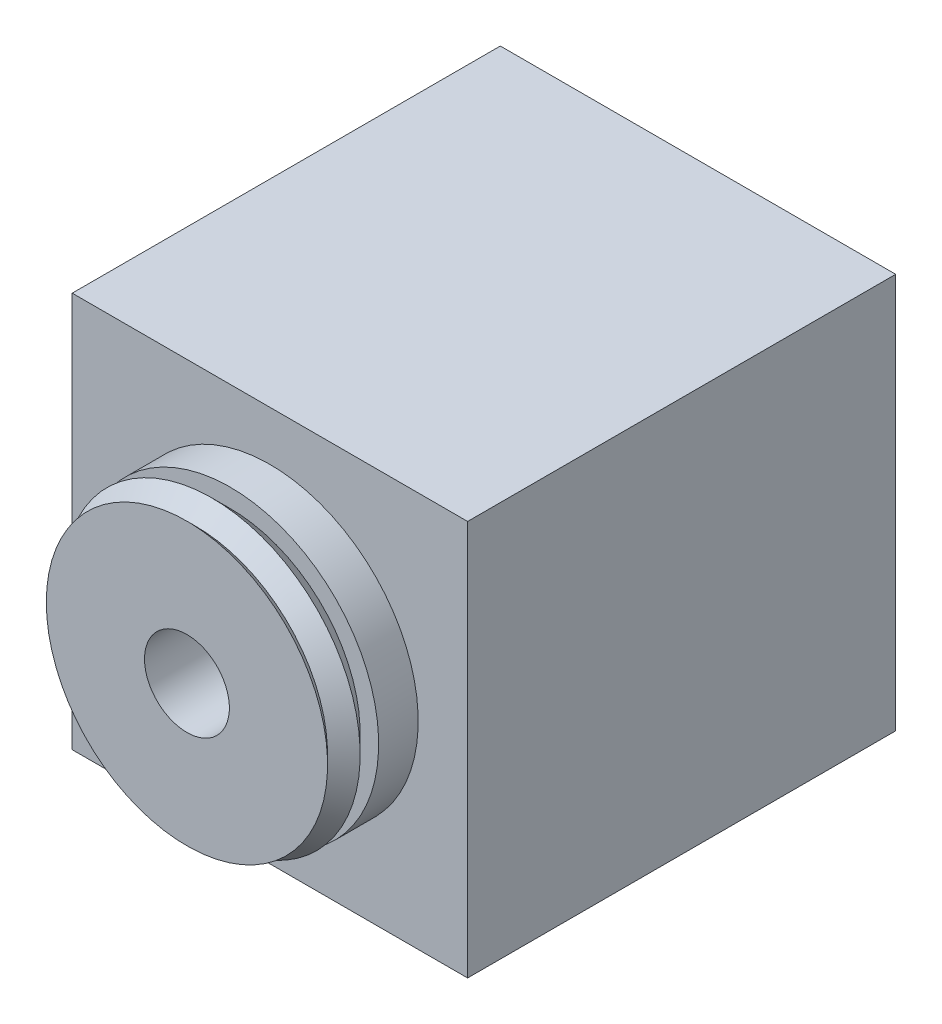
ISO-10303-21;
HEADER;
FILE_DESCRIPTION(('STEP AP214'),'2;1');
FILE_NAME('part.step','',(''),(''),'','','');
FILE_SCHEMA(('AUTOMOTIVE_DESIGN { 1 0 10303 214 1 1 1 1 }'));
ENDSEC;
DATA;
#1=APPLICATION_CONTEXT('core data for automotive mechanical design processes');
#2=APPLICATION_PROTOCOL_DEFINITION('international standard','automotive_design',2000,#1);
#3=PRODUCT_CONTEXT('',#1,'mechanical');
#4=PRODUCT('Part','Part','',(#3));
#5=PRODUCT_RELATED_PRODUCT_CATEGORY('part','',(#4));
#6=PRODUCT_DEFINITION_FORMATION('','',#4);
#7=PRODUCT_DEFINITION_CONTEXT('part definition',#1,'design');
#8=PRODUCT_DEFINITION('design','',#6,#7);
#9=PRODUCT_DEFINITION_SHAPE('','',#8);
#10=(LENGTH_UNIT() NAMED_UNIT(*) SI_UNIT(.MILLI.,.METRE.));
#11=(NAMED_UNIT(*) PLANE_ANGLE_UNIT() SI_UNIT($,.RADIAN.));
#12=(NAMED_UNIT(*) SI_UNIT($,.STERADIAN.) SOLID_ANGLE_UNIT());
#13=UNCERTAINTY_MEASURE_WITH_UNIT(LENGTH_MEASURE(1.E-05),#10,'distance_accuracy_value','');
#14=(GEOMETRIC_REPRESENTATION_CONTEXT(3) GLOBAL_UNCERTAINTY_ASSIGNED_CONTEXT((#13)) GLOBAL_UNIT_ASSIGNED_CONTEXT((#10,
#11,#12)) REPRESENTATION_CONTEXT('',''));
#15=CARTESIAN_POINT('',(0.,0.,0.));
#16=DIRECTION('',(0.,0.,1.));
#17=DIRECTION('',(1.,0.,0.));
#18=AXIS2_PLACEMENT_3D('',#15,#16,#17);
#19=CARTESIAN_POINT('',(0.,0.,0.));
#20=DIRECTION('',(0.,0.,1.));
#21=DIRECTION('',(1.,0.,0.));
#22=AXIS2_PLACEMENT_3D('',#19,#20,#21);
#23=PLANE('',#22);
#24=CARTESIAN_POINT('',(0.,0.,0.));
#25=DIRECTION('',(0.,0.,-1.));
#26=DIRECTION('',(-1.,0.,0.));
#27=AXIS2_PLACEMENT_3D('',#24,#25,#26);
#28=CIRCLE('',#27,6.77545);
#29=CARTESIAN_POINT('',(-6.77545,0.,0.));
#30=VERTEX_POINT('',#29);
#31=EDGE_CURVE('E11',#30,#30,#28,.T.);
#32=ORIENTED_EDGE('',*,*,#31,.F.);
#33=EDGE_LOOP('',(#32));
#34=FACE_BOUND('',#33,.T.);
#35=CARTESIAN_POINT('',(0.,0.,0.));
#36=DIRECTION('',(0.,0.,-1.));
#37=DIRECTION('',(-1.,0.,0.));
#38=AXIS2_PLACEMENT_3D('',#35,#36,#37);
#39=CIRCLE('',#38,2.0447);
#40=CARTESIAN_POINT('',(-2.0447,0.,0.));
#41=VERTEX_POINT('',#40);
#42=EDGE_CURVE('E152',#41,#41,#39,.T.);
#43=ORIENTED_EDGE('',*,*,#42,.T.);
#44=EDGE_LOOP('',(#43));
#45=FACE_BOUND('',#44,.T.);
#46=ADVANCED_FACE('F35',(#34,#45),#23,.T.);
#47=CARTESIAN_POINT('',(0.,0.,-26.197814));
#48=DIRECTION('',(0.,0.,-1.));
#49=DIRECTION('',(-1.,0.,0.));
#50=AXIS2_PLACEMENT_3D('',#47,#48,#49);
#51=PLANE('',#50);
#52=CARTESIAN_POINT('',(0.,0.,-26.197814));
#53=DIRECTION('',(0.,0.,-1.));
#54=DIRECTION('',(-1.,0.,0.));
#55=AXIS2_PLACEMENT_3D('',#52,#53,#54);
#56=CIRCLE('',#55,5.55625);
#57=CARTESIAN_POINT('',(-5.55625,0.,-26.197814));
#58=VERTEX_POINT('',#57);
#59=EDGE_CURVE('E160',#58,#58,#56,.T.);
#60=ORIENTED_EDGE('',*,*,#59,.T.);
#61=EDGE_LOOP('',(#60));
#62=FACE_BOUND('',#61,.T.);
#63=CARTESIAN_POINT('',(0.,0.,-26.197814));
#64=DIRECTION('',(0.,0.,-1.));
#65=DIRECTION('',(-1.,0.,0.));
#66=AXIS2_PLACEMENT_3D('',#63,#64,#65);
#67=CIRCLE('',#66,2.0447);
#68=CARTESIAN_POINT('',(-2.0447,0.,-26.197814));
#69=VERTEX_POINT('',#68);
#70=EDGE_CURVE('E154',#69,#69,#67,.T.);
#71=ORIENTED_EDGE('',*,*,#70,.F.);
#72=EDGE_LOOP('',(#71));
#73=FACE_BOUND('',#72,.T.);
#74=ADVANCED_FACE('F139',(#62,#73),#51,.T.);
#75=CARTESIAN_POINT('',(9.525,9.525,-24.623014));
#76=DIRECTION('',(0.,0.,-1.));
#77=DIRECTION('',(-1.,0.,0.));
#78=AXIS2_PLACEMENT_3D('',#75,#76,#77);
#79=PLANE('',#78);
#80=DIRECTION('',(0.,-1.,0.));
#81=VECTOR('',#80,1.);
#82=CARTESIAN_POINT('',(9.525,9.525,-24.623014));
#83=LINE('',#82,#81);
#84=CARTESIAN_POINT('',(9.525,9.525,-24.623014));
#85=VERTEX_POINT('',#84);
#86=CARTESIAN_POINT('',(9.525,-9.525,-24.623014));
#87=VERTEX_POINT('',#86);
#88=EDGE_CURVE('E88',#85,#87,#83,.T.);
#89=ORIENTED_EDGE('',*,*,#88,.T.);
#90=DIRECTION('',(-1.,0.,0.));
#91=VECTOR('',#90,1.);
#92=CARTESIAN_POINT('',(9.525,-9.525,-24.623014));
#93=LINE('',#92,#91);
#94=CARTESIAN_POINT('',(-9.525,-9.525,-24.623014));
#95=VERTEX_POINT('',#94);
#96=EDGE_CURVE('E82',#87,#95,#93,.T.);
#97=ORIENTED_EDGE('',*,*,#96,.T.);
#98=DIRECTION('',(0.,1.,0.));
#99=VECTOR('',#98,1.);
#100=CARTESIAN_POINT('',(-9.525,9.525,-24.623014));
#101=LINE('',#100,#99);
#102=CARTESIAN_POINT('',(-9.525,9.525,-24.623014));
#103=VERTEX_POINT('',#102);
#104=EDGE_CURVE('E86',#95,#103,#101,.T.);
#105=ORIENTED_EDGE('',*,*,#104,.T.);
#106=DIRECTION('',(1.,0.,0.));
#107=VECTOR('',#106,1.);
#108=CARTESIAN_POINT('',(9.525,9.525,-24.623014));
#109=LINE('',#108,#107);
#110=EDGE_CURVE('E51',#103,#85,#109,.T.);
#111=ORIENTED_EDGE('',*,*,#110,.T.);
#112=EDGE_LOOP('',(#89,#97,#105,#111));
#113=FACE_BOUND('',#112,.T.);
#114=CARTESIAN_POINT('',(-6.91950784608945,6.55087633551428,-24.623014));
#115=DIRECTION('',(0.,0.,-1.));
#116=DIRECTION('',(-1.,0.,0.));
#117=AXIS2_PLACEMENT_3D('',#114,#115,#116);
#118=CIRCLE('',#117,1.7272);
#119=CARTESIAN_POINT('',(-8.64670784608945,6.55087633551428,-24.623014));
#120=VERTEX_POINT('',#119);
#121=EDGE_CURVE('E181',#120,#120,#118,.T.);
#122=ORIENTED_EDGE('',*,*,#121,.F.);
#123=EDGE_LOOP('',(#122));
#124=FACE_BOUND('',#123,.T.);
#125=CARTESIAN_POINT('',(6.55087633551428,-6.91950784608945,-24.623014));
#126=DIRECTION('',(0.,0.,-1.));
#127=DIRECTION('',(1.,0.,0.));
#128=AXIS2_PLACEMENT_3D('',#125,#126,#127);
#129=CIRCLE('',#128,1.7272);
#130=CARTESIAN_POINT('',(8.27807633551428,-6.91950784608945,-24.623014));
#131=VERTEX_POINT('',#130);
#132=EDGE_CURVE('E175',#131,#131,#129,.T.);
#133=ORIENTED_EDGE('',*,*,#132,.F.);
#134=EDGE_LOOP('',(#133));
#135=FACE_BOUND('',#134,.T.);
#136=CARTESIAN_POINT('',(0.,0.,-24.623014));
#137=DIRECTION('',(0.,0.,-1.));
#138=DIRECTION('',(-1.,0.,0.));
#139=AXIS2_PLACEMENT_3D('',#136,#137,#138);
#140=CIRCLE('',#139,5.55625);
#141=CARTESIAN_POINT('',(-5.55625,0.,-24.623014));
#142=VERTEX_POINT('',#141);
#143=EDGE_CURVE('E157',#142,#142,#140,.T.);
#144=ORIENTED_EDGE('',*,*,#143,.F.);
#145=EDGE_LOOP('',(#144));
#146=FACE_BOUND('',#145,.T.);
#147=ADVANCED_FACE('F83',(#113,#124,#135,#146),#79,.T.);
#148=CARTESIAN_POINT('',(0.,0.,-0.416559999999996));
#149=DIRECTION('',(0.,0.,1.));
#150=DIRECTION('',(1.,0.,0.));
#151=AXIS2_PLACEMENT_3D('',#148,#149,#150);
#152=CONICAL_SURFACE('',#151,6.35889,0.785398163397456);
#153=ORIENTED_EDGE('',*,*,#31,.T.);
#154=EDGE_LOOP('',(#153));
#155=FACE_BOUND('',#154,.T.);
#156=CARTESIAN_POINT('',(0.,0.,-0.416559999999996));
#157=DIRECTION('',(0.,0.,-1.));
#158=DIRECTION('',(-1.,0.,0.));
#159=AXIS2_PLACEMENT_3D('',#156,#157,#158);
#160=CIRCLE('',#159,6.35889);
#161=CARTESIAN_POINT('',(-6.35889,0.,-0.416559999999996));
#162=VERTEX_POINT('',#161);
#163=EDGE_CURVE('E43',#162,#162,#160,.T.);
#164=ORIENTED_EDGE('',*,*,#163,.F.);
#165=EDGE_LOOP('',(#164));
#166=FACE_BOUND('',#165,.T.);
#167=ADVANCED_FACE('F130',(#155,#166),#152,.T.);
#168=CARTESIAN_POINT('',(0.,0.,-1.20141999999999));
#169=DIRECTION('',(0.,0.,-1.));
#170=DIRECTION('',(-1.,0.,0.));
#171=AXIS2_PLACEMENT_3D('',#168,#169,#170);
#172=CONICAL_SURFACE('',#171,7.14374999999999,0.785398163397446);
#173=ORIENTED_EDGE('',*,*,#163,.T.);
#174=EDGE_LOOP('',(#173));
#175=FACE_BOUND('',#174,.T.);
#176=CARTESIAN_POINT('',(0.,0.,-1.20141999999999));
#177=DIRECTION('',(0.,0.,-1.));
#178=DIRECTION('',(-1.,0.,0.));
#179=AXIS2_PLACEMENT_3D('',#176,#177,#178);
#180=CIRCLE('',#179,7.14374999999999);
#181=CARTESIAN_POINT('',(-7.14374999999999,0.,-1.20141999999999));
#182=VERTEX_POINT('',#181);
#183=EDGE_CURVE('E122',#182,#182,#180,.T.);
#184=ORIENTED_EDGE('',*,*,#183,.F.);
#185=EDGE_LOOP('',(#184));
#186=FACE_BOUND('',#185,.T.);
#187=ADVANCED_FACE('F127',(#175,#186),#172,.T.);
#188=CARTESIAN_POINT('',(0.,0.,-2.093214));
#189=DIRECTION('',(0.,0.,1.));
#190=DIRECTION('',(1.,0.,0.));
#191=AXIS2_PLACEMENT_3D('',#188,#189,#190);
#192=CONICAL_SURFACE('',#191,6.25195599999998,0.785398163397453);
#193=ORIENTED_EDGE('',*,*,#183,.T.);
#194=EDGE_LOOP('',(#193));
#195=FACE_BOUND('',#194,.T.);
#196=CARTESIAN_POINT('',(0.,0.,-2.093214));
#197=DIRECTION('',(0.,0.,-1.));
#198=DIRECTION('',(-1.,0.,0.));
#199=AXIS2_PLACEMENT_3D('',#196,#197,#198);
#200=CIRCLE('',#199,6.25195599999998);
#201=CARTESIAN_POINT('',(-6.25195599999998,0.,-2.093214));
#202=VERTEX_POINT('',#201);
#203=EDGE_CURVE('E119',#202,#202,#200,.T.);
#204=ORIENTED_EDGE('',*,*,#203,.F.);
#205=EDGE_LOOP('',(#204));
#206=FACE_BOUND('',#205,.T.);
#207=ADVANCED_FACE('F137',(#195,#206),#192,.T.);
#208=CARTESIAN_POINT('',(0.,6.25195599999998,-2.093214));
#209=DIRECTION('',(0.,0.,1.));
#210=DIRECTION('',(1.,0.,0.));
#211=AXIS2_PLACEMENT_3D('',#208,#209,#210);
#212=PLANE('',#211);
#213=ORIENTED_EDGE('',*,*,#203,.T.);
#214=EDGE_LOOP('',(#213));
#215=FACE_BOUND('',#214,.T.);
#216=CARTESIAN_POINT('',(0.,0.,-2.093214));
#217=DIRECTION('',(0.,0.,-1.));
#218=DIRECTION('',(-1.,0.,0.));
#219=AXIS2_PLACEMENT_3D('',#216,#217,#218);
#220=CIRCLE('',#219,7.14374999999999);
#221=CARTESIAN_POINT('',(-7.14374999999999,0.,-2.093214));
#222=VERTEX_POINT('',#221);
#223=EDGE_CURVE('E116',#222,#222,#220,.T.);
#224=ORIENTED_EDGE('',*,*,#223,.F.);
#225=EDGE_LOOP('',(#224));
#226=FACE_BOUND('',#225,.T.);
#227=ADVANCED_FACE('F257',(#215,#226),#212,.T.);
#228=CARTESIAN_POINT('',(0.,0.,-71.2941240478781));
#229=DIRECTION('',(0.,0.,-1.));
#230=DIRECTION('',(-1.,0.,0.));
#231=AXIS2_PLACEMENT_3D('',#228,#229,#230);
#232=CYLINDRICAL_SURFACE('',#231,7.14374999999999);
#233=ORIENTED_EDGE('',*,*,#223,.T.);
#234=EDGE_LOOP('',(#233));
#235=FACE_BOUND('',#234,.T.);
#236=CARTESIAN_POINT('',(0.,0.,-3.998214));
#237=DIRECTION('',(0.,0.,-1.));
#238=DIRECTION('',(-1.,0.,0.));
#239=AXIS2_PLACEMENT_3D('',#236,#237,#238);
#240=CIRCLE('',#239,7.14374999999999);
#241=CARTESIAN_POINT('',(-7.14374999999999,0.,-3.998214));
#242=VERTEX_POINT('',#241);
#243=EDGE_CURVE('E113',#242,#242,#240,.T.);
#244=ORIENTED_EDGE('',*,*,#243,.F.);
#245=EDGE_LOOP('',(#244));
#246=FACE_BOUND('',#245,.T.);
#247=ADVANCED_FACE('F253',(#235,#246),#232,.T.);
#248=CARTESIAN_POINT('',(9.525,9.525,-24.623014));
#249=DIRECTION('',(-1.,0.,0.));
#250=DIRECTION('',(0.,-1.,0.));
#251=AXIS2_PLACEMENT_3D('',#248,#249,#250);
#252=PLANE('',#251);
#253=DIRECTION('',(0.,-1.,0.));
#254=VECTOR('',#253,1.);
#255=CARTESIAN_POINT('',(9.525,9.525,-3.998214));
#256=LINE('',#255,#254);
#257=CARTESIAN_POINT('',(9.525,9.525,-3.998214));
#258=VERTEX_POINT('',#257);
#259=CARTESIAN_POINT('',(9.525,-9.525,-3.998214));
#260=VERTEX_POINT('',#259);
#261=EDGE_CURVE('E103',#258,#260,#256,.T.);
#262=ORIENTED_EDGE('',*,*,#261,.T.);
#263=DIRECTION('',(0.,0.,1.));
#264=VECTOR('',#263,1.);
#265=CARTESIAN_POINT('',(9.525,-9.525,-24.623014));
#266=LINE('',#265,#264);
#267=EDGE_CURVE('E94',#87,#260,#266,.T.);
#268=ORIENTED_EDGE('',*,*,#267,.F.);
#269=ORIENTED_EDGE('',*,*,#88,.F.);
#270=DIRECTION('',(0.,0.,1.));
#271=VECTOR('',#270,1.);
#272=CARTESIAN_POINT('',(9.525,9.525,-24.623014));
#273=LINE('',#272,#271);
#274=EDGE_CURVE('E99',#85,#258,#273,.T.);
#275=ORIENTED_EDGE('',*,*,#274,.T.);
#276=EDGE_LOOP('',(#262,#268,#269,#275));
#277=FACE_BOUND('',#276,.T.);
#278=ADVANCED_FACE('F250',(#277),#252,.F.);
#279=CARTESIAN_POINT('',(9.525,-9.525,-24.623014));
#280=DIRECTION('',(0.,1.,0.));
#281=DIRECTION('',(0.,0.,1.));
#282=AXIS2_PLACEMENT_3D('',#279,#280,#281);
#283=PLANE('',#282);
#284=DIRECTION('',(-1.,0.,0.));
#285=VECTOR('',#284,1.);
#286=CARTESIAN_POINT('',(9.525,-9.525,-3.998214));
#287=LINE('',#286,#285);
#288=CARTESIAN_POINT('',(-9.525,-9.525,-3.998214));
#289=VERTEX_POINT('',#288);
#290=EDGE_CURVE('E93',#260,#289,#287,.T.);
#291=ORIENTED_EDGE('',*,*,#290,.T.);
#292=DIRECTION('',(0.,0.,1.));
#293=VECTOR('',#292,1.);
#294=CARTESIAN_POINT('',(-9.525,-9.525,-24.623014));
#295=LINE('',#294,#293);
#296=EDGE_CURVE('E91',#95,#289,#295,.T.);
#297=ORIENTED_EDGE('',*,*,#296,.F.);
#298=ORIENTED_EDGE('',*,*,#96,.F.);
#299=ORIENTED_EDGE('',*,*,#267,.T.);
#300=EDGE_LOOP('',(#291,#297,#298,#299));
#301=FACE_BOUND('',#300,.T.);
#302=ADVANCED_FACE('F92',(#301),#283,.F.);
#303=CARTESIAN_POINT('',(-9.525,9.525,-24.623014));
#304=DIRECTION('',(1.,0.,0.));
#305=DIRECTION('',(0.,1.,0.));
#306=AXIS2_PLACEMENT_3D('',#303,#304,#305);
#307=PLANE('',#306);
#308=CARTESIAN_POINT('',(-9.525,-5.5499,-18.273014));
#309=DIRECTION('',(-1.,0.,0.));
#310=DIRECTION('',(0.,-1.,0.));
#311=AXIS2_PLACEMENT_3D('',#308,#309,#310);
#312=CIRCLE('',#311,1.7272);
#313=CARTESIAN_POINT('',(-9.525,-7.2771,-18.273014));
#314=VERTEX_POINT('',#313);
#315=EDGE_CURVE('E163',#314,#314,#312,.T.);
#316=ORIENTED_EDGE('',*,*,#315,.F.);
#317=EDGE_LOOP('',(#316));
#318=FACE_BOUND('',#317,.T.);
#319=CARTESIAN_POINT('',(-9.525,5.5499,-7.17321400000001));
#320=DIRECTION('',(-1.,0.,0.));
#321=DIRECTION('',(0.,-1.,0.));
#322=AXIS2_PLACEMENT_3D('',#319,#320,#321);
#323=CIRCLE('',#322,1.7272);
#324=CARTESIAN_POINT('',(-9.525,3.8227,-7.17321400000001));
#325=VERTEX_POINT('',#324);
#326=EDGE_CURVE('E169',#325,#325,#323,.T.);
#327=ORIENTED_EDGE('',*,*,#326,.F.);
#328=EDGE_LOOP('',(#327));
#329=FACE_BOUND('',#328,.T.);
#330=DIRECTION('',(0.,1.,0.));
#331=VECTOR('',#330,1.);
#332=CARTESIAN_POINT('',(-9.525,9.525,-3.998214));
#333=LINE('',#332,#331);
#334=CARTESIAN_POINT('',(-9.525,9.525,-3.998214));
#335=VERTEX_POINT('',#334);
#336=EDGE_CURVE('E68',#289,#335,#333,.T.);
#337=ORIENTED_EDGE('',*,*,#336,.T.);
#338=DIRECTION('',(0.,0.,1.));
#339=VECTOR('',#338,1.);
#340=CARTESIAN_POINT('',(-9.525,9.525,-24.623014));
#341=LINE('',#340,#339);
#342=EDGE_CURVE('E95',#103,#335,#341,.T.);
#343=ORIENTED_EDGE('',*,*,#342,.F.);
#344=ORIENTED_EDGE('',*,*,#104,.F.);
#345=ORIENTED_EDGE('',*,*,#296,.T.);
#346=EDGE_LOOP('',(#337,#343,#344,#345));
#347=FACE_BOUND('',#346,.T.);
#348=ADVANCED_FACE('F97',(#318,#329,#347),#307,.F.);
#349=CARTESIAN_POINT('',(9.525,9.525,-24.623014));
#350=DIRECTION('',(0.,-1.,0.));
#351=DIRECTION('',(0.,0.,-1.));
#352=AXIS2_PLACEMENT_3D('',#349,#350,#351);
#353=PLANE('',#352);
#354=DIRECTION('',(1.,0.,0.));
#355=VECTOR('',#354,1.);
#356=CARTESIAN_POINT('',(9.525,9.525,-3.998214));
#357=LINE('',#356,#355);
#358=EDGE_CURVE('E74',#335,#258,#357,.T.);
#359=ORIENTED_EDGE('',*,*,#358,.T.);
#360=ORIENTED_EDGE('',*,*,#274,.F.);
#361=ORIENTED_EDGE('',*,*,#110,.F.);
#362=ORIENTED_EDGE('',*,*,#342,.T.);
#363=EDGE_LOOP('',(#359,#360,#361,#362));
#364=FACE_BOUND('',#363,.T.);
#365=ADVANCED_FACE('F241',(#364),#353,.F.);
#366=CARTESIAN_POINT('',(9.525,9.525,-3.998214));
#367=DIRECTION('',(0.,0.,-1.));
#368=DIRECTION('',(-1.,0.,0.));
#369=AXIS2_PLACEMENT_3D('',#366,#367,#368);
#370=PLANE('',#369);
#371=ORIENTED_EDGE('',*,*,#243,.T.);
#372=EDGE_LOOP('',(#371));
#373=FACE_BOUND('',#372,.T.);
#374=ORIENTED_EDGE('',*,*,#261,.F.);
#375=ORIENTED_EDGE('',*,*,#358,.F.);
#376=ORIENTED_EDGE('',*,*,#336,.F.);
#377=ORIENTED_EDGE('',*,*,#290,.F.);
#378=EDGE_LOOP('',(#374,#375,#376,#377));
#379=FACE_BOUND('',#378,.T.);
#380=ADVANCED_FACE('F236',(#373,#379),#370,.F.);
#381=CARTESIAN_POINT('',(-6.91950784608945,6.55087633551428,-16.698214));
#382=DIRECTION('',(0.,0.,-1.));
#383=DIRECTION('',(-1.,0.,0.));
#384=AXIS2_PLACEMENT_3D('',#381,#382,#383);
#385=CYLINDRICAL_SURFACE('',#384,1.7272);
#386=CARTESIAN_POINT('',(-6.91950784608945,6.55087633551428,-16.698214));
#387=DIRECTION('',(0.,0.,-1.));
#388=DIRECTION('',(-1.,0.,0.));
#389=AXIS2_PLACEMENT_3D('',#386,#387,#388);
#390=CIRCLE('',#389,1.7272);
#391=CARTESIAN_POINT('',(-8.64670784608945,6.55087633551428,-16.698214));
#392=VERTEX_POINT('',#391);
#393=EDGE_CURVE('E106',#392,#392,#390,.T.);
#394=ORIENTED_EDGE('',*,*,#393,.F.);
#395=EDGE_LOOP('',(#394));
#396=FACE_BOUND('',#395,.T.);
#397=ORIENTED_EDGE('',*,*,#121,.T.);
#398=EDGE_LOOP('',(#397));
#399=FACE_BOUND('',#398,.T.);
#400=ADVANCED_FACE('F189',(#396,#399),#385,.F.);
#401=CARTESIAN_POINT('',(-6.91950784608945,6.55087633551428,-16.698214));
#402=DIRECTION('',(0.,0.,-1.));
#403=DIRECTION('',(-1.,0.,0.));
#404=AXIS2_PLACEMENT_3D('',#401,#402,#403);
#405=PLANE('',#404);
#406=ORIENTED_EDGE('',*,*,#393,.T.);
#407=EDGE_LOOP('',(#406));
#408=FACE_BOUND('',#407,.T.);
#409=ADVANCED_FACE('F230',(#408),#405,.T.);
#410=CARTESIAN_POINT('',(6.55087633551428,-6.91950784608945,-16.698214));
#411=DIRECTION('',(0.,0.,-1.));
#412=DIRECTION('',(-1.,0.,0.));
#413=AXIS2_PLACEMENT_3D('',#410,#411,#412);
#414=CYLINDRICAL_SURFACE('',#413,1.7272);
#415=CARTESIAN_POINT('',(6.55087633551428,-6.91950784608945,-16.698214));
#416=DIRECTION('',(0.,0.,-1.));
#417=DIRECTION('',(1.,0.,0.));
#418=AXIS2_PLACEMENT_3D('',#415,#416,#417);
#419=CIRCLE('',#418,1.7272);
#420=CARTESIAN_POINT('',(8.27807633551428,-6.91950784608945,-16.698214));
#421=VERTEX_POINT('',#420);
#422=EDGE_CURVE('E178',#421,#421,#419,.T.);
#423=ORIENTED_EDGE('',*,*,#422,.F.);
#424=EDGE_LOOP('',(#423));
#425=FACE_BOUND('',#424,.T.);
#426=ORIENTED_EDGE('',*,*,#132,.T.);
#427=EDGE_LOOP('',(#426));
#428=FACE_BOUND('',#427,.T.);
#429=ADVANCED_FACE('F226',(#425,#428),#414,.F.);
#430=CARTESIAN_POINT('',(6.55087633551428,-6.91950784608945,-16.698214));
#431=DIRECTION('',(0.,0.,1.));
#432=DIRECTION('',(1.,0.,0.));
#433=AXIS2_PLACEMENT_3D('',#430,#431,#432);
#434=PLANE('',#433);
#435=ORIENTED_EDGE('',*,*,#422,.T.);
#436=EDGE_LOOP('',(#435));
#437=FACE_BOUND('',#436,.T.);
#438=ADVANCED_FACE('F222',(#437),#434,.F.);
#439=CARTESIAN_POINT('',(-4.7752,5.5499,-7.17321400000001));
#440=DIRECTION('',(-1.,0.,0.));
#441=DIRECTION('',(0.,-1.,0.));
#442=AXIS2_PLACEMENT_3D('',#439,#440,#441);
#443=CYLINDRICAL_SURFACE('',#442,1.7272);
#444=CARTESIAN_POINT('',(-4.7752,5.5499,-7.17321400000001));
#445=DIRECTION('',(-1.,0.,0.));
#446=DIRECTION('',(0.,-1.,0.));
#447=AXIS2_PLACEMENT_3D('',#444,#445,#446);
#448=CIRCLE('',#447,1.7272);
#449=CARTESIAN_POINT('',(-4.7752,3.8227,-7.17321400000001));
#450=VERTEX_POINT('',#449);
#451=EDGE_CURVE('E172',#450,#450,#448,.T.);
#452=ORIENTED_EDGE('',*,*,#451,.F.);
#453=EDGE_LOOP('',(#452));
#454=FACE_BOUND('',#453,.T.);
#455=ORIENTED_EDGE('',*,*,#326,.T.);
#456=EDGE_LOOP('',(#455));
#457=FACE_BOUND('',#456,.T.);
#458=ADVANCED_FACE('F218',(#454,#457),#443,.F.);
#459=CARTESIAN_POINT('',(-4.7752,5.5499,-7.17321400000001));
#460=DIRECTION('',(-1.,0.,0.));
#461=DIRECTION('',(0.,-1.,0.));
#462=AXIS2_PLACEMENT_3D('',#459,#460,#461);
#463=PLANE('',#462);
#464=ORIENTED_EDGE('',*,*,#451,.T.);
#465=EDGE_LOOP('',(#464));
#466=FACE_BOUND('',#465,.T.);
#467=ADVANCED_FACE('F214',(#466),#463,.T.);
#468=CARTESIAN_POINT('',(-4.7752,-5.5499,-18.273014));
#469=DIRECTION('',(-1.,0.,0.));
#470=DIRECTION('',(0.,-1.,0.));
#471=AXIS2_PLACEMENT_3D('',#468,#469,#470);
#472=CYLINDRICAL_SURFACE('',#471,1.7272);
#473=CARTESIAN_POINT('',(-4.7752,-5.5499,-18.273014));
#474=DIRECTION('',(-1.,0.,0.));
#475=DIRECTION('',(0.,-1.,0.));
#476=AXIS2_PLACEMENT_3D('',#473,#474,#475);
#477=CIRCLE('',#476,1.7272);
#478=CARTESIAN_POINT('',(-4.7752,-7.2771,-18.273014));
#479=VERTEX_POINT('',#478);
#480=EDGE_CURVE('E166',#479,#479,#477,.T.);
#481=ORIENTED_EDGE('',*,*,#480,.F.);
#482=EDGE_LOOP('',(#481));
#483=FACE_BOUND('',#482,.T.);
#484=ORIENTED_EDGE('',*,*,#315,.T.);
#485=EDGE_LOOP('',(#484));
#486=FACE_BOUND('',#485,.T.);
#487=ADVANCED_FACE('F207',(#483,#486),#472,.F.);
#488=CARTESIAN_POINT('',(-4.7752,-5.5499,-18.273014));
#489=DIRECTION('',(-1.,0.,0.));
#490=DIRECTION('',(0.,-1.,0.));
#491=AXIS2_PLACEMENT_3D('',#488,#489,#490);
#492=PLANE('',#491);
#493=ORIENTED_EDGE('',*,*,#480,.T.);
#494=EDGE_LOOP('',(#493));
#495=FACE_BOUND('',#494,.T.);
#496=ADVANCED_FACE('F198',(#495),#492,.T.);
#497=CARTESIAN_POINT('',(0.,0.,-26.197814));
#498=DIRECTION('',(0.,0.,1.));
#499=DIRECTION('',(1.,0.,0.));
#500=AXIS2_PLACEMENT_3D('',#497,#498,#499);
#501=CYLINDRICAL_SURFACE('',#500,5.55625);
#502=ORIENTED_EDGE('',*,*,#59,.F.);
#503=EDGE_LOOP('',(#502));
#504=FACE_BOUND('',#503,.T.);
#505=ORIENTED_EDGE('',*,*,#143,.T.);
#506=EDGE_LOOP('',(#505));
#507=FACE_BOUND('',#506,.T.);
#508=ADVANCED_FACE('F195',(#504,#507),#501,.T.);
#509=CARTESIAN_POINT('',(0.,0.,-26.197814));
#510=DIRECTION('',(0.,0.,1.));
#511=DIRECTION('',(1.,0.,0.));
#512=AXIS2_PLACEMENT_3D('',#509,#510,#511);
#513=CYLINDRICAL_SURFACE('',#512,2.0447);
#514=ORIENTED_EDGE('',*,*,#70,.T.);
#515=EDGE_LOOP('',(#514));
#516=FACE_BOUND('',#515,.T.);
#517=ORIENTED_EDGE('',*,*,#42,.F.);
#518=EDGE_LOOP('',(#517));
#519=FACE_BOUND('',#518,.T.);
#520=ADVANCED_FACE('F197',(#516,#519),#513,.F.);
#521=CLOSED_SHELL('',(#46,#74,#147,#167,#187,#207,#227,#247,#278,#302,#348,#365,#380,#400,#409,
#429,#438,#458,#467,#487,#496,#508,#520));
#522=MANIFOLD_SOLID_BREP('B2',#521);
#523=ADVANCED_BREP_SHAPE_REPRESENTATION('',(#18,#522),#14);
#524=SHAPE_DEFINITION_REPRESENTATION(#9,#523);
ENDSEC;
END-ISO-10303-21;
